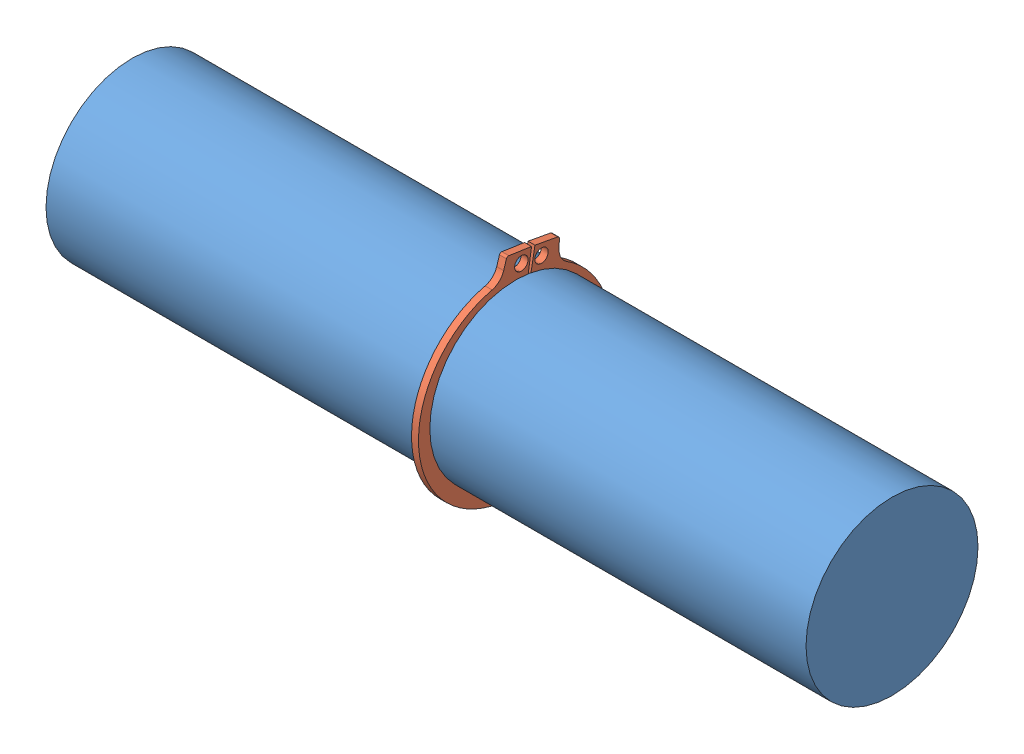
SolidWorks assembly ring_defining_assembly.sldasm, configuration Default (file format 3042). Lengths in mm.
Overall size (175 54.74 51.63).
2 component instances, 2 part files, 2 mates.
Components (placement in the parent):
- shaft-1: shaft.SLDPRT [Ø40] at origin size (175 39.6 39.6)
- retaining_ring-1: retaining_ring.SLDPRT [40mm shaft] x (0 -0.164748 -0.986336) z (-1 0 0) size (44.31 48.1 1.6)
Mates (geometry in assembly coordinates):
- Concentric1: concentric anti-aligned: cylinder of shaft-1; cylinder of retaining_ring-1
- Width1: width: plane of shaft-1; plane of shaft-1; plane of retaining_ring-1; plane of retaining_ring-1
